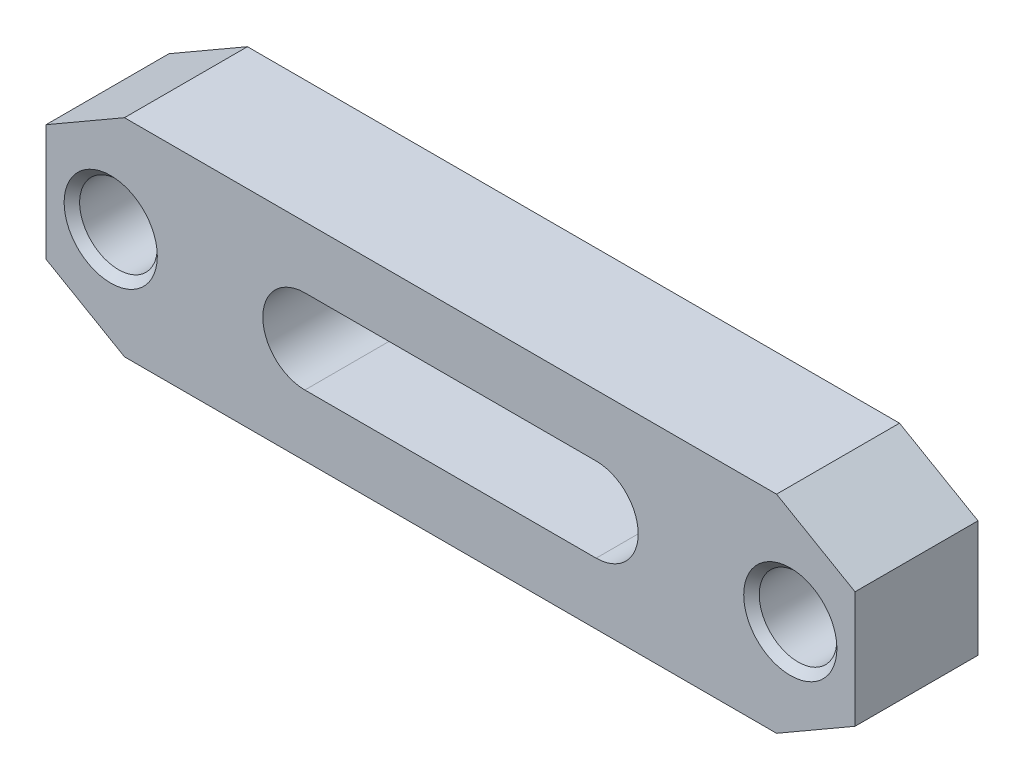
ISO-10303-21;
HEADER;
FILE_DESCRIPTION(('STEP AP214'),'2;1');
FILE_NAME('part.step','',(''),(''),'','','');
FILE_SCHEMA(('AUTOMOTIVE_DESIGN { 1 0 10303 214 1 1 1 1 }'));
ENDSEC;
DATA;
#1=APPLICATION_CONTEXT('core data for automotive mechanical design processes');
#2=APPLICATION_PROTOCOL_DEFINITION('international standard','automotive_design',2000,#1);
#3=PRODUCT_CONTEXT('',#1,'mechanical');
#4=PRODUCT('Part','Part','',(#3));
#5=PRODUCT_RELATED_PRODUCT_CATEGORY('part','',(#4));
#6=PRODUCT_DEFINITION_FORMATION('','',#4);
#7=PRODUCT_DEFINITION_CONTEXT('part definition',#1,'design');
#8=PRODUCT_DEFINITION('design','',#6,#7);
#9=PRODUCT_DEFINITION_SHAPE('','',#8);
#10=(LENGTH_UNIT() NAMED_UNIT(*) SI_UNIT(.MILLI.,.METRE.));
#11=(NAMED_UNIT(*) PLANE_ANGLE_UNIT() SI_UNIT($,.RADIAN.));
#12=(NAMED_UNIT(*) SI_UNIT($,.STERADIAN.) SOLID_ANGLE_UNIT());
#13=UNCERTAINTY_MEASURE_WITH_UNIT(LENGTH_MEASURE(1.E-05),#10,'distance_accuracy_value','');
#14=(GEOMETRIC_REPRESENTATION_CONTEXT(3) GLOBAL_UNCERTAINTY_ASSIGNED_CONTEXT((#13)) GLOBAL_UNIT_ASSIGNED_CONTEXT((#10,
#11,#12)) REPRESENTATION_CONTEXT('',''));
#15=CARTESIAN_POINT('',(0.,0.,0.));
#16=DIRECTION('',(0.,0.,1.));
#17=DIRECTION('',(1.,0.,0.));
#18=AXIS2_PLACEMENT_3D('',#15,#16,#17);
#19=CARTESIAN_POINT('',(62.5,-16.,19.));
#20=DIRECTION('',(0.,0.,1.));
#21=DIRECTION('',(1.,0.,0.));
#22=AXIS2_PLACEMENT_3D('',#19,#20,#21);
#23=PLANE('',#22);
#24=CARTESIAN_POINT('',(52.5,0.,19.));
#25=DIRECTION('',(0.,0.,-1.));
#26=DIRECTION('',(-1.,0.,0.));
#27=AXIS2_PLACEMENT_3D('',#24,#25,#26);
#28=CIRCLE('',#27,7.2);
#29=CARTESIAN_POINT('',(45.3,0.,19.));
#30=VERTEX_POINT('',#29);
#31=EDGE_CURVE('E212',#30,#30,#28,.T.);
#32=ORIENTED_EDGE('',*,*,#31,.T.);
#33=EDGE_LOOP('',(#32));
#34=FACE_BOUND('',#33,.T.);
#35=CARTESIAN_POINT('',(-52.5,0.,19.));
#36=DIRECTION('',(0.,0.,-1.));
#37=DIRECTION('',(-1.,0.,0.));
#38=AXIS2_PLACEMENT_3D('',#35,#36,#37);
#39=CIRCLE('',#38,7.2);
#40=CARTESIAN_POINT('',(-59.7,0.,19.));
#41=VERTEX_POINT('',#40);
#42=EDGE_CURVE('E133',#41,#41,#39,.T.);
#43=ORIENTED_EDGE('',*,*,#42,.T.);
#44=EDGE_LOOP('',(#43));
#45=FACE_BOUND('',#44,.T.);
#46=DIRECTION('',(1.,0.,0.));
#47=VECTOR('',#46,1.);
#48=CARTESIAN_POINT('',(-50.375644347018,-16.,19.));
#49=LINE('',#48,#47);
#50=CARTESIAN_POINT('',(-50.375644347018,-16.,19.));
#51=VERTEX_POINT('',#50);
#52=CARTESIAN_POINT('',(50.375644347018,-16.,19.));
#53=VERTEX_POINT('',#52);
#54=EDGE_CURVE('E143',#51,#53,#49,.T.);
#55=ORIENTED_EDGE('',*,*,#54,.T.);
#56=DIRECTION('',(0.866025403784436,0.5,0.));
#57=VECTOR('',#56,1.);
#58=CARTESIAN_POINT('',(50.375644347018,-16.,19.));
#59=LINE('',#58,#57);
#60=CARTESIAN_POINT('',(62.5,-9.,19.));
#61=VERTEX_POINT('',#60);
#62=EDGE_CURVE('E146',#53,#61,#59,.T.);
#63=ORIENTED_EDGE('',*,*,#62,.T.);
#64=DIRECTION('',(0.,1.,0.));
#65=VECTOR('',#64,1.);
#66=CARTESIAN_POINT('',(62.5,-9.,19.));
#67=LINE('',#66,#65);
#68=CARTESIAN_POINT('',(62.5,9.,19.));
#69=VERTEX_POINT('',#68);
#70=EDGE_CURVE('E149',#61,#69,#67,.T.);
#71=ORIENTED_EDGE('',*,*,#70,.T.);
#72=DIRECTION('',(-0.866025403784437,0.5,0.));
#73=VECTOR('',#72,1.);
#74=CARTESIAN_POINT('',(50.375644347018,16.,19.));
#75=LINE('',#74,#73);
#76=CARTESIAN_POINT('',(50.375644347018,16.,19.));
#77=VERTEX_POINT('',#76);
#78=EDGE_CURVE('E151',#69,#77,#75,.T.);
#79=ORIENTED_EDGE('',*,*,#78,.T.);
#80=DIRECTION('',(-1.,0.,0.));
#81=VECTOR('',#80,1.);
#82=CARTESIAN_POINT('',(-50.375644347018,16.,19.));
#83=LINE('',#82,#81);
#84=CARTESIAN_POINT('',(-50.375644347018,16.,19.));
#85=VERTEX_POINT('',#84);
#86=EDGE_CURVE('E153',#77,#85,#83,.T.);
#87=ORIENTED_EDGE('',*,*,#86,.T.);
#88=DIRECTION('',(-0.866025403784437,-0.5,0.));
#89=VECTOR('',#88,1.);
#90=CARTESIAN_POINT('',(-50.375644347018,16.,19.));
#91=LINE('',#90,#89);
#92=CARTESIAN_POINT('',(-62.5,9.,19.));
#93=VERTEX_POINT('',#92);
#94=EDGE_CURVE('E155',#85,#93,#91,.T.);
#95=ORIENTED_EDGE('',*,*,#94,.T.);
#96=DIRECTION('',(0.,-1.,0.));
#97=VECTOR('',#96,1.);
#98=CARTESIAN_POINT('',(-62.5,-9.,19.));
#99=LINE('',#98,#97);
#100=CARTESIAN_POINT('',(-62.5,-9.,19.));
#101=VERTEX_POINT('',#100);
#102=EDGE_CURVE('E157',#93,#101,#99,.T.);
#103=ORIENTED_EDGE('',*,*,#102,.T.);
#104=DIRECTION('',(0.866025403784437,-0.5,0.));
#105=VECTOR('',#104,1.);
#106=CARTESIAN_POINT('',(-50.375644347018,-16.,19.));
#107=LINE('',#106,#105);
#108=EDGE_CURVE('E159',#101,#51,#107,.T.);
#109=ORIENTED_EDGE('',*,*,#108,.T.);
#110=EDGE_LOOP('',(#55,#63,#71,#79,#87,#95,#103,#109));
#111=FACE_BOUND('',#110,.T.);
#112=DIRECTION('',(-1.,0.,0.));
#113=VECTOR('',#112,1.);
#114=CARTESIAN_POINT('',(22.5,6.5,19.));
#115=LINE('',#114,#113);
#116=CARTESIAN_POINT('',(22.5,6.5,19.));
#117=VERTEX_POINT('',#116);
#118=CARTESIAN_POINT('',(-22.5,6.5,19.));
#119=VERTEX_POINT('',#118);
#120=EDGE_CURVE('E113',#117,#119,#115,.T.);
#121=ORIENTED_EDGE('',*,*,#120,.F.);
#122=CARTESIAN_POINT('',(22.5,0.,19.));
#123=DIRECTION('',(0.,0.,1.));
#124=DIRECTION('',(1.,0.,0.));
#125=AXIS2_PLACEMENT_3D('',#122,#123,#124);
#126=CIRCLE('',#125,6.5);
#127=CARTESIAN_POINT('',(22.5,-6.5,19.));
#128=VERTEX_POINT('',#127);
#129=EDGE_CURVE('E105',#128,#117,#126,.T.);
#130=ORIENTED_EDGE('',*,*,#129,.F.);
#131=DIRECTION('',(1.,0.,0.));
#132=VECTOR('',#131,1.);
#133=CARTESIAN_POINT('',(22.5,-6.5,19.));
#134=LINE('',#133,#132);
#135=CARTESIAN_POINT('',(-22.5,-6.5,19.));
#136=VERTEX_POINT('',#135);
#137=EDGE_CURVE('E127',#136,#128,#134,.T.);
#138=ORIENTED_EDGE('',*,*,#137,.F.);
#139=CARTESIAN_POINT('',(-22.5,0.,19.));
#140=DIRECTION('',(0.,0.,1.));
#141=DIRECTION('',(1.,0.,0.));
#142=AXIS2_PLACEMENT_3D('',#139,#140,#141);
#143=CIRCLE('',#142,6.5);
#144=EDGE_CURVE('E125',#119,#136,#143,.T.);
#145=ORIENTED_EDGE('',*,*,#144,.F.);
#146=EDGE_LOOP('',(#121,#130,#138,#145));
#147=FACE_BOUND('',#146,.T.);
#148=ADVANCED_FACE('F14',(#34,#45,#111,#147),#23,.T.);
#149=CARTESIAN_POINT('',(62.5,-16.,0.));
#150=DIRECTION('',(0.,0.,1.));
#151=DIRECTION('',(1.,0.,0.));
#152=AXIS2_PLACEMENT_3D('',#149,#150,#151);
#153=PLANE('',#152);
#154=CARTESIAN_POINT('',(52.5,0.,0.));
#155=DIRECTION('',(0.,0.,-1.));
#156=DIRECTION('',(-1.,0.,0.));
#157=AXIS2_PLACEMENT_3D('',#154,#155,#156);
#158=CIRCLE('',#157,7.2);
#159=CARTESIAN_POINT('',(45.3,0.,0.));
#160=VERTEX_POINT('',#159);
#161=EDGE_CURVE('E202',#160,#160,#158,.T.);
#162=ORIENTED_EDGE('',*,*,#161,.F.);
#163=EDGE_LOOP('',(#162));
#164=FACE_BOUND('',#163,.T.);
#165=CARTESIAN_POINT('',(-52.5,0.,0.));
#166=DIRECTION('',(0.,0.,-1.));
#167=DIRECTION('',(-1.,0.,0.));
#168=AXIS2_PLACEMENT_3D('',#165,#166,#167);
#169=CIRCLE('',#168,7.2);
#170=CARTESIAN_POINT('',(-59.7,0.,0.));
#171=VERTEX_POINT('',#170);
#172=EDGE_CURVE('E215',#171,#171,#169,.T.);
#173=ORIENTED_EDGE('',*,*,#172,.F.);
#174=EDGE_LOOP('',(#173));
#175=FACE_BOUND('',#174,.T.);
#176=DIRECTION('',(1.,0.,0.));
#177=VECTOR('',#176,1.);
#178=CARTESIAN_POINT('',(-50.375644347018,-16.,0.));
#179=LINE('',#178,#177);
#180=CARTESIAN_POINT('',(-50.375644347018,-16.,0.));
#181=VERTEX_POINT('',#180);
#182=CARTESIAN_POINT('',(50.375644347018,-16.,0.));
#183=VERTEX_POINT('',#182);
#184=EDGE_CURVE('E121',#181,#183,#179,.T.);
#185=ORIENTED_EDGE('',*,*,#184,.F.);
#186=DIRECTION('',(0.866025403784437,-0.5,0.));
#187=VECTOR('',#186,1.);
#188=CARTESIAN_POINT('',(-50.375644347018,-16.,0.));
#189=LINE('',#188,#187);
#190=CARTESIAN_POINT('',(-62.5,-9.,0.));
#191=VERTEX_POINT('',#190);
#192=EDGE_CURVE('E147',#191,#181,#189,.T.);
#193=ORIENTED_EDGE('',*,*,#192,.F.);
#194=DIRECTION('',(0.,-1.,0.));
#195=VECTOR('',#194,1.);
#196=CARTESIAN_POINT('',(-62.5,-9.,0.));
#197=LINE('',#196,#195);
#198=CARTESIAN_POINT('',(-62.5,9.,0.));
#199=VERTEX_POINT('',#198);
#200=EDGE_CURVE('E174',#199,#191,#197,.T.);
#201=ORIENTED_EDGE('',*,*,#200,.F.);
#202=DIRECTION('',(-0.866025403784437,-0.5,0.));
#203=VECTOR('',#202,1.);
#204=CARTESIAN_POINT('',(-50.375644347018,16.,0.));
#205=LINE('',#204,#203);
#206=CARTESIAN_POINT('',(-50.375644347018,16.,0.));
#207=VERTEX_POINT('',#206);
#208=EDGE_CURVE('E172',#207,#199,#205,.T.);
#209=ORIENTED_EDGE('',*,*,#208,.F.);
#210=DIRECTION('',(-1.,0.,0.));
#211=VECTOR('',#210,1.);
#212=CARTESIAN_POINT('',(-50.375644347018,16.,0.));
#213=LINE('',#212,#211);
#214=CARTESIAN_POINT('',(50.375644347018,16.,0.));
#215=VERTEX_POINT('',#214);
#216=EDGE_CURVE('E170',#215,#207,#213,.T.);
#217=ORIENTED_EDGE('',*,*,#216,.F.);
#218=DIRECTION('',(-0.866025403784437,0.5,0.));
#219=VECTOR('',#218,1.);
#220=CARTESIAN_POINT('',(50.375644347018,16.,0.));
#221=LINE('',#220,#219);
#222=CARTESIAN_POINT('',(62.5,9.,0.));
#223=VERTEX_POINT('',#222);
#224=EDGE_CURVE('E168',#223,#215,#221,.T.);
#225=ORIENTED_EDGE('',*,*,#224,.F.);
#226=DIRECTION('',(0.,1.,0.));
#227=VECTOR('',#226,1.);
#228=CARTESIAN_POINT('',(62.5,-9.,0.));
#229=LINE('',#228,#227);
#230=CARTESIAN_POINT('',(62.5,-9.,0.));
#231=VERTEX_POINT('',#230);
#232=EDGE_CURVE('E166',#231,#223,#229,.T.);
#233=ORIENTED_EDGE('',*,*,#232,.F.);
#234=DIRECTION('',(0.866025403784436,0.5,0.));
#235=VECTOR('',#234,1.);
#236=CARTESIAN_POINT('',(50.375644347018,-16.,0.));
#237=LINE('',#236,#235);
#238=EDGE_CURVE('E164',#183,#231,#237,.T.);
#239=ORIENTED_EDGE('',*,*,#238,.F.);
#240=EDGE_LOOP('',(#185,#193,#201,#209,#217,#225,#233,#239));
#241=FACE_BOUND('',#240,.T.);
#242=CARTESIAN_POINT('',(22.5,0.,0.));
#243=DIRECTION('',(0.,0.,1.));
#244=DIRECTION('',(1.,0.,0.));
#245=AXIS2_PLACEMENT_3D('',#242,#243,#244);
#246=CIRCLE('',#245,6.5);
#247=CARTESIAN_POINT('',(22.5,-6.5,0.));
#248=VERTEX_POINT('',#247);
#249=CARTESIAN_POINT('',(22.5,6.5,0.));
#250=VERTEX_POINT('',#249);
#251=EDGE_CURVE('E39',#248,#250,#246,.T.);
#252=ORIENTED_EDGE('',*,*,#251,.T.);
#253=DIRECTION('',(-1.,0.,0.));
#254=VECTOR('',#253,1.);
#255=CARTESIAN_POINT('',(22.5,6.5,0.));
#256=LINE('',#255,#254);
#257=CARTESIAN_POINT('',(-22.5,6.5,0.));
#258=VERTEX_POINT('',#257);
#259=EDGE_CURVE('E120',#250,#258,#256,.T.);
#260=ORIENTED_EDGE('',*,*,#259,.T.);
#261=CARTESIAN_POINT('',(-22.5,0.,0.));
#262=DIRECTION('',(0.,0.,1.));
#263=DIRECTION('',(1.,0.,0.));
#264=AXIS2_PLACEMENT_3D('',#261,#262,#263);
#265=CIRCLE('',#264,6.5);
#266=CARTESIAN_POINT('',(-22.5,-6.5,0.));
#267=VERTEX_POINT('',#266);
#268=EDGE_CURVE('E135',#258,#267,#265,.T.);
#269=ORIENTED_EDGE('',*,*,#268,.T.);
#270=DIRECTION('',(1.,0.,0.));
#271=VECTOR('',#270,1.);
#272=CARTESIAN_POINT('',(22.5,-6.5,0.));
#273=LINE('',#272,#271);
#274=EDGE_CURVE('E114',#267,#248,#273,.T.);
#275=ORIENTED_EDGE('',*,*,#274,.T.);
#276=EDGE_LOOP('',(#252,#260,#269,#275));
#277=FACE_BOUND('',#276,.T.);
#278=ADVANCED_FACE('F238',(#164,#175,#241,#277),#153,.F.);
#279=CARTESIAN_POINT('',(-50.375644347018,-16.,19.));
#280=DIRECTION('',(0.,1.,0.));
#281=DIRECTION('',(-1.,0.,0.));
#282=AXIS2_PLACEMENT_3D('',#279,#280,#281);
#283=PLANE('',#282);
#284=ORIENTED_EDGE('',*,*,#184,.T.);
#285=DIRECTION('',(0.,0.,-1.));
#286=VECTOR('',#285,1.);
#287=CARTESIAN_POINT('',(50.375644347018,-16.,19.));
#288=LINE('',#287,#286);
#289=EDGE_CURVE('E9',#53,#183,#288,.T.);
#290=ORIENTED_EDGE('',*,*,#289,.F.);
#291=ORIENTED_EDGE('',*,*,#54,.F.);
#292=DIRECTION('',(0.,0.,-1.));
#293=VECTOR('',#292,1.);
#294=CARTESIAN_POINT('',(-50.375644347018,-16.,19.));
#295=LINE('',#294,#293);
#296=EDGE_CURVE('E161',#51,#181,#295,.T.);
#297=ORIENTED_EDGE('',*,*,#296,.T.);
#298=EDGE_LOOP('',(#284,#290,#291,#297));
#299=FACE_BOUND('',#298,.T.);
#300=ADVANCED_FACE('F16',(#299),#283,.F.);
#301=CARTESIAN_POINT('',(50.375644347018,-16.,19.));
#302=DIRECTION('',(-0.5,0.866025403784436,0.));
#303=DIRECTION('',(-0.866025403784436,-0.5,0.));
#304=AXIS2_PLACEMENT_3D('',#301,#302,#303);
#305=PLANE('',#304);
#306=ORIENTED_EDGE('',*,*,#238,.T.);
#307=DIRECTION('',(0.,0.,-1.));
#308=VECTOR('',#307,1.);
#309=CARTESIAN_POINT('',(62.5,-9.,19.));
#310=LINE('',#309,#308);
#311=EDGE_CURVE('E23',#61,#231,#310,.T.);
#312=ORIENTED_EDGE('',*,*,#311,.F.);
#313=ORIENTED_EDGE('',*,*,#62,.F.);
#314=ORIENTED_EDGE('',*,*,#289,.T.);
#315=EDGE_LOOP('',(#306,#312,#313,#314));
#316=FACE_BOUND('',#315,.T.);
#317=ADVANCED_FACE('F271',(#316),#305,.F.);
#318=CARTESIAN_POINT('',(62.5,-9.,19.));
#319=DIRECTION('',(-1.,0.,0.));
#320=DIRECTION('',(0.,0.,1.));
#321=AXIS2_PLACEMENT_3D('',#318,#319,#320);
#322=PLANE('',#321);
#323=ORIENTED_EDGE('',*,*,#232,.T.);
#324=DIRECTION('',(0.,0.,-1.));
#325=VECTOR('',#324,1.);
#326=CARTESIAN_POINT('',(62.5,9.,19.));
#327=LINE('',#326,#325);
#328=EDGE_CURVE('E191',#69,#223,#327,.T.);
#329=ORIENTED_EDGE('',*,*,#328,.F.);
#330=ORIENTED_EDGE('',*,*,#70,.F.);
#331=ORIENTED_EDGE('',*,*,#311,.T.);
#332=EDGE_LOOP('',(#323,#329,#330,#331));
#333=FACE_BOUND('',#332,.T.);
#334=ADVANCED_FACE('F268',(#333),#322,.F.);
#335=CARTESIAN_POINT('',(50.375644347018,16.,19.));
#336=DIRECTION('',(-0.5,-0.866025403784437,0.));
#337=DIRECTION('',(0.866025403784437,-0.5,0.));
#338=AXIS2_PLACEMENT_3D('',#335,#336,#337);
#339=PLANE('',#338);
#340=ORIENTED_EDGE('',*,*,#224,.T.);
#341=DIRECTION('',(0.,0.,-1.));
#342=VECTOR('',#341,1.);
#343=CARTESIAN_POINT('',(50.375644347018,16.,19.));
#344=LINE('',#343,#342);
#345=EDGE_CURVE('E188',#77,#215,#344,.T.);
#346=ORIENTED_EDGE('',*,*,#345,.F.);
#347=ORIENTED_EDGE('',*,*,#78,.F.);
#348=ORIENTED_EDGE('',*,*,#328,.T.);
#349=EDGE_LOOP('',(#340,#346,#347,#348));
#350=FACE_BOUND('',#349,.T.);
#351=ADVANCED_FACE('F264',(#350),#339,.F.);
#352=CARTESIAN_POINT('',(-50.375644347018,16.,19.));
#353=DIRECTION('',(0.,-1.,0.));
#354=DIRECTION('',(0.,0.,-1.));
#355=AXIS2_PLACEMENT_3D('',#352,#353,#354);
#356=PLANE('',#355);
#357=ORIENTED_EDGE('',*,*,#216,.T.);
#358=DIRECTION('',(0.,0.,-1.));
#359=VECTOR('',#358,1.);
#360=CARTESIAN_POINT('',(-50.375644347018,16.,19.));
#361=LINE('',#360,#359);
#362=EDGE_CURVE('E185',#85,#207,#361,.T.);
#363=ORIENTED_EDGE('',*,*,#362,.F.);
#364=ORIENTED_EDGE('',*,*,#86,.F.);
#365=ORIENTED_EDGE('',*,*,#345,.T.);
#366=EDGE_LOOP('',(#357,#363,#364,#365));
#367=FACE_BOUND('',#366,.T.);
#368=ADVANCED_FACE('F260',(#367),#356,.F.);
#369=CARTESIAN_POINT('',(-50.375644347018,16.,19.));
#370=DIRECTION('',(0.5,-0.866025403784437,0.));
#371=DIRECTION('',(0.866025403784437,0.5,0.));
#372=AXIS2_PLACEMENT_3D('',#369,#370,#371);
#373=PLANE('',#372);
#374=ORIENTED_EDGE('',*,*,#208,.T.);
#375=DIRECTION('',(0.,0.,-1.));
#376=VECTOR('',#375,1.);
#377=CARTESIAN_POINT('',(-62.5,9.,19.));
#378=LINE('',#377,#376);
#379=EDGE_CURVE('E182',#93,#199,#378,.T.);
#380=ORIENTED_EDGE('',*,*,#379,.F.);
#381=ORIENTED_EDGE('',*,*,#94,.F.);
#382=ORIENTED_EDGE('',*,*,#362,.T.);
#383=EDGE_LOOP('',(#374,#380,#381,#382));
#384=FACE_BOUND('',#383,.T.);
#385=ADVANCED_FACE('F256',(#384),#373,.F.);
#386=CARTESIAN_POINT('',(-62.5,-9.,19.));
#387=DIRECTION('',(1.,0.,0.));
#388=DIRECTION('',(0.,0.,-1.));
#389=AXIS2_PLACEMENT_3D('',#386,#387,#388);
#390=PLANE('',#389);
#391=ORIENTED_EDGE('',*,*,#200,.T.);
#392=DIRECTION('',(0.,0.,-1.));
#393=VECTOR('',#392,1.);
#394=CARTESIAN_POINT('',(-62.5,-9.,19.));
#395=LINE('',#394,#393);
#396=EDGE_CURVE('E179',#101,#191,#395,.T.);
#397=ORIENTED_EDGE('',*,*,#396,.F.);
#398=ORIENTED_EDGE('',*,*,#102,.F.);
#399=ORIENTED_EDGE('',*,*,#379,.T.);
#400=EDGE_LOOP('',(#391,#397,#398,#399));
#401=FACE_BOUND('',#400,.T.);
#402=ADVANCED_FACE('F252',(#401),#390,.F.);
#403=CARTESIAN_POINT('',(-50.375644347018,-16.,19.));
#404=DIRECTION('',(0.5,0.866025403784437,0.));
#405=DIRECTION('',(-0.866025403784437,0.5,0.));
#406=AXIS2_PLACEMENT_3D('',#403,#404,#405);
#407=PLANE('',#406);
#408=ORIENTED_EDGE('',*,*,#192,.T.);
#409=ORIENTED_EDGE('',*,*,#296,.F.);
#410=ORIENTED_EDGE('',*,*,#108,.F.);
#411=ORIENTED_EDGE('',*,*,#396,.T.);
#412=EDGE_LOOP('',(#408,#409,#410,#411));
#413=FACE_BOUND('',#412,.T.);
#414=ADVANCED_FACE('F249',(#413),#407,.F.);
#415=CARTESIAN_POINT('',(22.5,0.,19.));
#416=DIRECTION('',(0.,0.,-1.));
#417=DIRECTION('',(-1.,0.,0.));
#418=AXIS2_PLACEMENT_3D('',#415,#416,#417);
#419=CYLINDRICAL_SURFACE('',#418,6.5);
#420=ORIENTED_EDGE('',*,*,#251,.F.);
#421=DIRECTION('',(0.,0.,-1.));
#422=VECTOR('',#421,1.);
#423=CARTESIAN_POINT('',(22.5,-6.5,19.));
#424=LINE('',#423,#422);
#425=EDGE_CURVE('E109',#128,#248,#424,.T.);
#426=ORIENTED_EDGE('',*,*,#425,.F.);
#427=ORIENTED_EDGE('',*,*,#129,.T.);
#428=DIRECTION('',(0.,0.,-1.));
#429=VECTOR('',#428,1.);
#430=CARTESIAN_POINT('',(22.5,6.5,19.));
#431=LINE('',#430,#429);
#432=EDGE_CURVE('E108',#117,#250,#431,.T.);
#433=ORIENTED_EDGE('',*,*,#432,.T.);
#434=EDGE_LOOP('',(#420,#426,#427,#433));
#435=FACE_BOUND('',#434,.T.);
#436=ADVANCED_FACE('F107',(#435),#419,.F.);
#437=CARTESIAN_POINT('',(22.5,6.5,19.));
#438=DIRECTION('',(0.,-1.,0.));
#439=DIRECTION('',(1.,0.,0.));
#440=AXIS2_PLACEMENT_3D('',#437,#438,#439);
#441=PLANE('',#440);
#442=ORIENTED_EDGE('',*,*,#259,.F.);
#443=ORIENTED_EDGE('',*,*,#432,.F.);
#444=ORIENTED_EDGE('',*,*,#120,.T.);
#445=DIRECTION('',(0.,0.,-1.));
#446=VECTOR('',#445,1.);
#447=CARTESIAN_POINT('',(-22.5,6.5,19.));
#448=LINE('',#447,#446);
#449=EDGE_CURVE('E122',#119,#258,#448,.T.);
#450=ORIENTED_EDGE('',*,*,#449,.T.);
#451=EDGE_LOOP('',(#442,#443,#444,#450));
#452=FACE_BOUND('',#451,.T.);
#453=ADVANCED_FACE('F117',(#452),#441,.T.);
#454=CARTESIAN_POINT('',(-22.5,0.,19.));
#455=DIRECTION('',(0.,0.,-1.));
#456=DIRECTION('',(-1.,0.,0.));
#457=AXIS2_PLACEMENT_3D('',#454,#455,#456);
#458=CYLINDRICAL_SURFACE('',#457,6.5);
#459=ORIENTED_EDGE('',*,*,#268,.F.);
#460=ORIENTED_EDGE('',*,*,#449,.F.);
#461=ORIENTED_EDGE('',*,*,#144,.T.);
#462=DIRECTION('',(0.,0.,-1.));
#463=VECTOR('',#462,1.);
#464=CARTESIAN_POINT('',(-22.5,-6.5,19.));
#465=LINE('',#464,#463);
#466=EDGE_CURVE('E31',#136,#267,#465,.T.);
#467=ORIENTED_EDGE('',*,*,#466,.T.);
#468=EDGE_LOOP('',(#459,#460,#461,#467));
#469=FACE_BOUND('',#468,.T.);
#470=ADVANCED_FACE('F235',(#469),#458,.F.);
#471=CARTESIAN_POINT('',(22.5,-6.5,19.));
#472=DIRECTION('',(0.,1.,0.));
#473=DIRECTION('',(-1.,0.,0.));
#474=AXIS2_PLACEMENT_3D('',#471,#472,#473);
#475=PLANE('',#474);
#476=ORIENTED_EDGE('',*,*,#274,.F.);
#477=ORIENTED_EDGE('',*,*,#466,.F.);
#478=ORIENTED_EDGE('',*,*,#137,.T.);
#479=ORIENTED_EDGE('',*,*,#425,.T.);
#480=EDGE_LOOP('',(#476,#477,#478,#479));
#481=FACE_BOUND('',#480,.T.);
#482=ADVANCED_FACE('F225',(#481),#475,.T.);
#483=CARTESIAN_POINT('',(-52.5,0.,17.));
#484=DIRECTION('',(0.,0.,1.));
#485=DIRECTION('',(1.,0.,0.));
#486=AXIS2_PLACEMENT_3D('',#483,#484,#485);
#487=CONICAL_SURFACE('',#486,5.2,0.78539816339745);
#488=CARTESIAN_POINT('',(-52.5,0.,17.8));
#489=DIRECTION('',(0.,0.,1.));
#490=DIRECTION('',(1.,0.,0.));
#491=AXIS2_PLACEMENT_3D('',#488,#489,#490);
#492=CIRCLE('',#491,6.);
#493=CARTESIAN_POINT('',(-46.5,0.,17.8));
#494=VERTEX_POINT('',#493);
#495=EDGE_CURVE('E197',#494,#494,#492,.F.);
#496=ORIENTED_EDGE('',*,*,#495,.T.);
#497=EDGE_LOOP('',(#496));
#498=FACE_BOUND('',#497,.T.);
#499=ORIENTED_EDGE('',*,*,#42,.F.);
#500=EDGE_LOOP('',(#499));
#501=FACE_BOUND('',#500,.T.);
#502=ADVANCED_FACE('F222',(#498,#501),#487,.F.);
#503=CARTESIAN_POINT('',(-52.5,0.,0.));
#504=DIRECTION('',(0.,0.,-1.));
#505=DIRECTION('',(-1.,0.,0.));
#506=AXIS2_PLACEMENT_3D('',#503,#504,#505);
#507=CONICAL_SURFACE('',#506,7.2,0.78539816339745);
#508=CARTESIAN_POINT('',(-52.5,0.,1.2));
#509=DIRECTION('',(0.,0.,-1.));
#510=DIRECTION('',(-1.,0.,0.));
#511=AXIS2_PLACEMENT_3D('',#508,#509,#510);
#512=CIRCLE('',#511,6.);
#513=CARTESIAN_POINT('',(-58.5,0.,1.2));
#514=VERTEX_POINT('',#513);
#515=EDGE_CURVE('E195',#514,#514,#512,.F.);
#516=ORIENTED_EDGE('',*,*,#515,.T.);
#517=EDGE_LOOP('',(#516));
#518=FACE_BOUND('',#517,.T.);
#519=ORIENTED_EDGE('',*,*,#172,.T.);
#520=EDGE_LOOP('',(#519));
#521=FACE_BOUND('',#520,.T.);
#522=ADVANCED_FACE('F224',(#518,#521),#507,.F.);
#523=CARTESIAN_POINT('',(52.5,0.,17.));
#524=DIRECTION('',(0.,0.,1.));
#525=DIRECTION('',(1.,0.,0.));
#526=AXIS2_PLACEMENT_3D('',#523,#524,#525);
#527=CONICAL_SURFACE('',#526,5.2,0.78539816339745);
#528=CARTESIAN_POINT('',(52.5,0.,17.8));
#529=DIRECTION('',(0.,0.,1.));
#530=DIRECTION('',(1.,0.,0.));
#531=AXIS2_PLACEMENT_3D('',#528,#529,#530);
#532=CIRCLE('',#531,6.);
#533=CARTESIAN_POINT('',(58.5,0.,17.8));
#534=VERTEX_POINT('',#533);
#535=EDGE_CURVE('E198',#534,#534,#532,.F.);
#536=ORIENTED_EDGE('',*,*,#535,.T.);
#537=EDGE_LOOP('',(#536));
#538=FACE_BOUND('',#537,.T.);
#539=ORIENTED_EDGE('',*,*,#31,.F.);
#540=EDGE_LOOP('',(#539));
#541=FACE_BOUND('',#540,.T.);
#542=ADVANCED_FACE('F233',(#538,#541),#527,.F.);
#543=CARTESIAN_POINT('',(52.5,0.,0.));
#544=DIRECTION('',(0.,0.,-1.));
#545=DIRECTION('',(-1.,0.,0.));
#546=AXIS2_PLACEMENT_3D('',#543,#544,#545);
#547=CONICAL_SURFACE('',#546,7.2,0.78539816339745);
#548=CARTESIAN_POINT('',(52.5,0.,1.2));
#549=DIRECTION('',(0.,0.,-1.));
#550=DIRECTION('',(-1.,0.,0.));
#551=AXIS2_PLACEMENT_3D('',#548,#549,#550);
#552=CIRCLE('',#551,6.);
#553=CARTESIAN_POINT('',(46.5,0.,1.2));
#554=VERTEX_POINT('',#553);
#555=EDGE_CURVE('E18',#554,#554,#552,.F.);
#556=ORIENTED_EDGE('',*,*,#555,.T.);
#557=EDGE_LOOP('',(#556));
#558=FACE_BOUND('',#557,.T.);
#559=ORIENTED_EDGE('',*,*,#161,.T.);
#560=EDGE_LOOP('',(#559));
#561=FACE_BOUND('',#560,.T.);
#562=ADVANCED_FACE('F398',(#558,#561),#547,.F.);
#563=CARTESIAN_POINT('',(-52.5,0.,0.));
#564=DIRECTION('',(0.,0.,1.));
#565=DIRECTION('',(1.,0.,0.));
#566=AXIS2_PLACEMENT_3D('',#563,#564,#565);
#567=CYLINDRICAL_SURFACE('',#566,6.);
#568=ORIENTED_EDGE('',*,*,#515,.F.);
#569=EDGE_LOOP('',(#568));
#570=FACE_BOUND('',#569,.T.);
#571=ORIENTED_EDGE('',*,*,#495,.F.);
#572=EDGE_LOOP('',(#571));
#573=FACE_BOUND('',#572,.T.);
#574=ADVANCED_FACE('F407',(#570,#573),#567,.F.);
#575=CARTESIAN_POINT('',(52.5,0.,0.));
#576=DIRECTION('',(0.,0.,1.));
#577=DIRECTION('',(1.,0.,0.));
#578=AXIS2_PLACEMENT_3D('',#575,#576,#577);
#579=CYLINDRICAL_SURFACE('',#578,6.);
#580=ORIENTED_EDGE('',*,*,#555,.F.);
#581=EDGE_LOOP('',(#580));
#582=FACE_BOUND('',#581,.T.);
#583=ORIENTED_EDGE('',*,*,#535,.F.);
#584=EDGE_LOOP('',(#583));
#585=FACE_BOUND('',#584,.T.);
#586=ADVANCED_FACE('F417',(#582,#585),#579,.F.);
#587=CLOSED_SHELL('',(#148,#278,#300,#317,#334,#351,#368,#385,#402,#414,#436,#453,#470,#482,
#502,#522,#542,#562,#574,#586));
#588=MANIFOLD_SOLID_BREP('B1',#587);
#589=ADVANCED_BREP_SHAPE_REPRESENTATION('',(#18,#588),#14);
#590=SHAPE_DEFINITION_REPRESENTATION(#9,#589);
ENDSEC;
END-ISO-10303-21;
